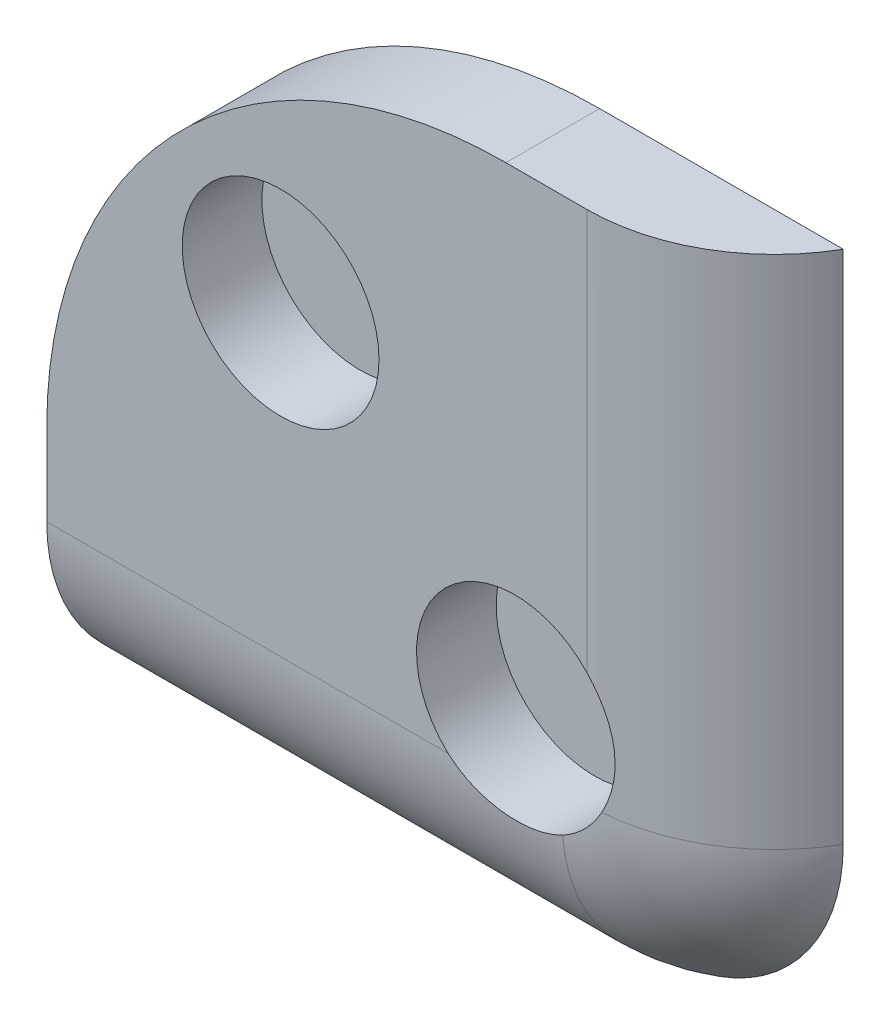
ISO-10303-21;
HEADER;
FILE_DESCRIPTION(('STEP AP214'),'2;1');
FILE_NAME('part.step','',(''),(''),'','','');
FILE_SCHEMA(('AUTOMOTIVE_DESIGN { 1 0 10303 214 1 1 1 1 }'));
ENDSEC;
DATA;
#1=APPLICATION_CONTEXT('core data for automotive mechanical design processes');
#2=APPLICATION_PROTOCOL_DEFINITION('international standard','automotive_design',2000,#1);
#3=PRODUCT_CONTEXT('',#1,'mechanical');
#4=PRODUCT('Part','Part','',(#3));
#5=PRODUCT_RELATED_PRODUCT_CATEGORY('part','',(#4));
#6=PRODUCT_DEFINITION_FORMATION('','',#4);
#7=PRODUCT_DEFINITION_CONTEXT('part definition',#1,'design');
#8=PRODUCT_DEFINITION('design','',#6,#7);
#9=PRODUCT_DEFINITION_SHAPE('','',#8);
#10=(LENGTH_UNIT() NAMED_UNIT(*) SI_UNIT(.MILLI.,.METRE.));
#11=(NAMED_UNIT(*) PLANE_ANGLE_UNIT() SI_UNIT($,.RADIAN.));
#12=(NAMED_UNIT(*) SI_UNIT($,.STERADIAN.) SOLID_ANGLE_UNIT());
#13=UNCERTAINTY_MEASURE_WITH_UNIT(LENGTH_MEASURE(1.E-05),#10,'distance_accuracy_value','');
#14=(GEOMETRIC_REPRESENTATION_CONTEXT(3) GLOBAL_UNCERTAINTY_ASSIGNED_CONTEXT((#13)) GLOBAL_UNIT_ASSIGNED_CONTEXT((#10,
#11,#12)) REPRESENTATION_CONTEXT('',''));
#15=CARTESIAN_POINT('',(0.,0.,0.));
#16=DIRECTION('',(0.,0.,1.));
#17=DIRECTION('',(1.,0.,0.));
#18=AXIS2_PLACEMENT_3D('',#15,#16,#17);
#19=CARTESIAN_POINT('',(-7.5,-7.5,-1.));
#20=DIRECTION('',(-1.,0.,0.));
#21=DIRECTION('',(0.,-1.,0.));
#22=AXIS2_PLACEMENT_3D('',#19,#20,#21);
#23=PLANE('',#22);
#24=DIRECTION('',(0.,-1.,0.));
#25=VECTOR('',#24,1.);
#26=CARTESIAN_POINT('',(-7.5,-7.5,-1.));
#27=LINE('',#26,#25);
#28=CARTESIAN_POINT('',(-7.5,-2.3,-1.));
#29=VERTEX_POINT('',#28);
#30=CARTESIAN_POINT('',(-7.5,-7.5,-1.));
#31=VERTEX_POINT('',#30);
#32=EDGE_CURVE('E162',#29,#31,#27,.T.);
#33=ORIENTED_EDGE('',*,*,#32,.T.);
#34=CARTESIAN_POINT('',(-7.5,-4.03589838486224,-3.));
#35=DIRECTION('',(-1.,0.,0.));
#36=DIRECTION('',(0.,-1.,0.));
#37=AXIS2_PLACEMENT_3D('',#34,#35,#36);
#38=CIRCLE('',#37,4.);
#39=CARTESIAN_POINT('',(-7.5,-4.03589838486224,1.));
#40=VERTEX_POINT('',#39);
#41=EDGE_CURVE('E56',#31,#40,#38,.T.);
#42=ORIENTED_EDGE('',*,*,#41,.T.);
#43=DIRECTION('',(0.,-1.,0.));
#44=VECTOR('',#43,1.);
#45=CARTESIAN_POINT('',(-7.5,-7.5,1.));
#46=LINE('',#45,#44);
#47=CARTESIAN_POINT('',(-7.5,-2.3,1.));
#48=VERTEX_POINT('',#47);
#49=EDGE_CURVE('E144',#48,#40,#46,.T.);
#50=ORIENTED_EDGE('',*,*,#49,.F.);
#51=DIRECTION('',(0.,0.,1.));
#52=VECTOR('',#51,1.);
#53=CARTESIAN_POINT('',(-7.5,-2.3,-1.));
#54=LINE('',#53,#52);
#55=EDGE_CURVE('E168',#29,#48,#54,.T.);
#56=ORIENTED_EDGE('',*,*,#55,.F.);
#57=EDGE_LOOP('',(#33,#42,#50,#56));
#58=FACE_BOUND('',#57,.T.);
#59=ADVANCED_FACE('F41',(#58),#23,.T.);
#60=CARTESIAN_POINT('',(2.3,-2.3,-1.));
#61=DIRECTION('',(0.,0.,1.));
#62=DIRECTION('',(1.,0.,0.));
#63=AXIS2_PLACEMENT_3D('',#60,#61,#62);
#64=CYLINDRICAL_SURFACE('',#63,9.8);
#65=ORIENTED_EDGE('',*,*,#55,.T.);
#66=CARTESIAN_POINT('',(2.3,-2.3,1.));
#67=DIRECTION('',(0.,0.,1.));
#68=DIRECTION('',(-1.,0.,0.));
#69=AXIS2_PLACEMENT_3D('',#66,#67,#68);
#70=CIRCLE('',#69,9.8);
#71=CARTESIAN_POINT('',(2.3,7.5,1.));
#72=VERTEX_POINT('',#71);
#73=EDGE_CURVE('E140',#72,#48,#70,.T.);
#74=ORIENTED_EDGE('',*,*,#73,.F.);
#75=DIRECTION('',(0.,0.,1.));
#76=VECTOR('',#75,1.);
#77=CARTESIAN_POINT('',(2.3,7.5,-1.));
#78=LINE('',#77,#76);
#79=CARTESIAN_POINT('',(2.3,7.5,-1.));
#80=VERTEX_POINT('',#79);
#81=EDGE_CURVE('E167',#80,#72,#78,.T.);
#82=ORIENTED_EDGE('',*,*,#81,.F.);
#83=CARTESIAN_POINT('',(2.3,-2.3,-1.));
#84=DIRECTION('',(0.,0.,1.));
#85=DIRECTION('',(-1.,0.,0.));
#86=AXIS2_PLACEMENT_3D('',#83,#84,#85);
#87=CIRCLE('',#86,9.8);
#88=EDGE_CURVE('E159',#80,#29,#87,.T.);
#89=ORIENTED_EDGE('',*,*,#88,.T.);
#90=EDGE_LOOP('',(#65,#74,#82,#89));
#91=FACE_BOUND('',#90,.T.);
#92=ADVANCED_FACE('F207',(#91),#64,.T.);
#93=CARTESIAN_POINT('',(2.3,7.5,-1.));
#94=DIRECTION('',(0.,1.,0.));
#95=DIRECTION('',(-1.,0.,0.));
#96=AXIS2_PLACEMENT_3D('',#93,#94,#95);
#97=PLANE('',#96);
#98=DIRECTION('',(-1.,0.,0.));
#99=VECTOR('',#98,1.);
#100=CARTESIAN_POINT('',(2.3,7.5,1.));
#101=LINE('',#100,#99);
#102=CARTESIAN_POINT('',(4.03589838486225,7.5,1.));
#103=VERTEX_POINT('',#102);
#104=EDGE_CURVE('E135',#103,#72,#101,.T.);
#105=ORIENTED_EDGE('',*,*,#104,.F.);
#106=CARTESIAN_POINT('',(4.03589838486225,7.5,-3.));
#107=DIRECTION('',(0.,1.,0.));
#108=DIRECTION('',(-1.,0.,0.));
#109=AXIS2_PLACEMENT_3D('',#106,#107,#108);
#110=CIRCLE('',#109,4.);
#111=CARTESIAN_POINT('',(7.5,7.5,-1.));
#112=VERTEX_POINT('',#111);
#113=EDGE_CURVE('E123',#103,#112,#110,.T.);
#114=ORIENTED_EDGE('',*,*,#113,.T.);
#115=DIRECTION('',(-1.,0.,0.));
#116=VECTOR('',#115,1.);
#117=CARTESIAN_POINT('',(2.3,7.5,-1.));
#118=LINE('',#117,#116);
#119=EDGE_CURVE('E156',#112,#80,#118,.T.);
#120=ORIENTED_EDGE('',*,*,#119,.T.);
#121=ORIENTED_EDGE('',*,*,#81,.T.);
#122=EDGE_LOOP('',(#105,#114,#120,#121));
#123=FACE_BOUND('',#122,.T.);
#124=ADVANCED_FACE('F204',(#123),#97,.T.);
#125=CARTESIAN_POINT('',(2.3,-2.3,-1.));
#126=DIRECTION('',(0.,0.,-1.));
#127=DIRECTION('',(-1.,0.,0.));
#128=AXIS2_PLACEMENT_3D('',#125,#126,#127);
#129=PLANE('',#128);
#130=DIRECTION('',(0.,1.,0.));
#131=VECTOR('',#130,1.);
#132=CARTESIAN_POINT('',(7.5,-7.5,-1.));
#133=LINE('',#132,#131);
#134=CARTESIAN_POINT('',(7.5,-3.5,-1.));
#135=VERTEX_POINT('',#134);
#136=EDGE_CURVE('E154',#135,#112,#133,.T.);
#137=ORIENTED_EDGE('',*,*,#136,.F.);
#138=CARTESIAN_POINT('',(3.5,-3.5,-1.));
#139=DIRECTION('',(0.,0.,-1.));
#140=DIRECTION('',(-1.,0.,0.));
#141=AXIS2_PLACEMENT_3D('',#138,#139,#140);
#142=CIRCLE('',#141,4.);
#143=CARTESIAN_POINT('',(3.5,-7.5,-1.));
#144=VERTEX_POINT('',#143);
#145=EDGE_CURVE('E127',#135,#144,#142,.T.);
#146=ORIENTED_EDGE('',*,*,#145,.T.);
#147=DIRECTION('',(1.,0.,0.));
#148=VECTOR('',#147,1.);
#149=CARTESIAN_POINT('',(-7.5,-7.5,-1.));
#150=LINE('',#149,#148);
#151=EDGE_CURVE('E164',#31,#144,#150,.T.);
#152=ORIENTED_EDGE('',*,*,#151,.F.);
#153=ORIENTED_EDGE('',*,*,#32,.F.);
#154=ORIENTED_EDGE('',*,*,#88,.F.);
#155=ORIENTED_EDGE('',*,*,#119,.F.);
#156=EDGE_LOOP('',(#137,#146,#152,#153,#154,#155));
#157=FACE_BOUND('',#156,.T.);
#158=ADVANCED_FACE('F173',(#157),#129,.T.);
#159=CARTESIAN_POINT('',(2.3,-2.3,1.));
#160=DIRECTION('',(0.,0.,-1.));
#161=DIRECTION('',(-1.,0.,0.));
#162=AXIS2_PLACEMENT_3D('',#159,#160,#161);
#163=PLANE('',#162);
#164=CARTESIAN_POINT('',(-2.50832611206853,2.50832611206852,1.));
#165=DIRECTION('',(0.,0.,1.));
#166=DIRECTION('',(1.,0.,0.));
#167=AXIS2_PLACEMENT_3D('',#164,#165,#166);
#168=CIRCLE('',#167,2.1);
#169=CARTESIAN_POINT('',(-0.408326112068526,2.50832611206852,1.));
#170=VERTEX_POINT('',#169);
#171=EDGE_CURVE('E118',#170,#170,#168,.T.);
#172=ORIENTED_EDGE('',*,*,#171,.F.);
#173=EDGE_LOOP('',(#172));
#174=FACE_BOUND('',#173,.T.);
#175=DIRECTION('',(1.,0.,0.));
#176=VECTOR('',#175,1.);
#177=CARTESIAN_POINT('',(2.3,-4.03589838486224,1.));
#178=LINE('',#177,#176);
#179=CARTESIAN_POINT('',(1.06851869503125,-4.03589838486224,1.));
#180=VERTEX_POINT('',#179);
#181=EDGE_CURVE('E117',#40,#180,#178,.T.);
#182=ORIENTED_EDGE('',*,*,#181,.T.);
#183=CARTESIAN_POINT('',(2.49167388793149,-2.49167388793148,1.));
#184=DIRECTION('',(0.,0.,1.));
#185=DIRECTION('',(1.,0.,0.));
#186=AXIS2_PLACEMENT_3D('',#183,#184,#185);
#187=CIRCLE('',#186,2.1);
#188=CARTESIAN_POINT('',(4.03589838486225,-1.06851869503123,1.));
#189=VERTEX_POINT('',#188);
#190=EDGE_CURVE('E106',#189,#180,#187,.T.);
#191=ORIENTED_EDGE('',*,*,#190,.F.);
#192=DIRECTION('',(0.,1.,0.));
#193=VECTOR('',#192,1.);
#194=CARTESIAN_POINT('',(4.03589838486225,-2.3,1.));
#195=LINE('',#194,#193);
#196=EDGE_CURVE('E114',#189,#103,#195,.T.);
#197=ORIENTED_EDGE('',*,*,#196,.T.);
#198=ORIENTED_EDGE('',*,*,#104,.T.);
#199=ORIENTED_EDGE('',*,*,#73,.T.);
#200=ORIENTED_EDGE('',*,*,#49,.T.);
#201=EDGE_LOOP('',(#182,#191,#197,#198,#199,#200));
#202=FACE_BOUND('',#201,.T.);
#203=ADVANCED_FACE('F113',(#174,#202),#163,.F.);
#204=CARTESIAN_POINT('',(-7.5,-4.03589838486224,-3.));
#205=DIRECTION('',(1.,0.,0.));
#206=DIRECTION('',(0.,1.,0.));
#207=AXIS2_PLACEMENT_3D('',#204,#205,#206);
#208=CYLINDRICAL_SURFACE('',#207,4.);
#209=CARTESIAN_POINT('',(1.29891616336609,-0.76328475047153,-0.7));
#210=CARTESIAN_POINT('',(1.24232976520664,-0.802378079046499,-0.644351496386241));
#211=CARTESIAN_POINT('',(1.18795494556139,-0.843966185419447,-0.588215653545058));
#212=CARTESIAN_POINT('',(1.08359246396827,-0.932180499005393,-0.47571405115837));
#213=CARTESIAN_POINT('',(1.0336083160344,-0.978810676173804,-0.419348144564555));
#214=CARTESIAN_POINT('',(0.937667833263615,-1.07752076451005,-0.306737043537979));
#215=CARTESIAN_POINT('',(0.891750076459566,-1.12964432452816,-0.250497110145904));
#216=CARTESIAN_POINT('',(0.804752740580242,-1.2390045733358,-0.139324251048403));
#217=CARTESIAN_POINT('',(0.763671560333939,-1.29623955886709,-0.0843908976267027));
#218=CARTESIAN_POINT('',(0.661279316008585,-1.45550925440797,0.0593318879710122));
#219=CARTESIAN_POINT('',(0.604576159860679,-1.56212165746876,0.146463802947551));
#220=CARTESIAN_POINT('',(0.509011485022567,-1.78875654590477,0.312090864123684));
#221=CARTESIAN_POINT('',(0.470090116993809,-1.90873233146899,0.390614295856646));
#222=CARTESIAN_POINT('',(0.41918827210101,-2.13697373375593,0.52251218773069));
#223=CARTESIAN_POINT('',(0.403546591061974,-2.24327540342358,0.577848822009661));
#224=CARTESIAN_POINT('',(0.389051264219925,-2.46147747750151,0.679079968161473));
#225=CARTESIAN_POINT('',(0.390193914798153,-2.57337664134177,0.724976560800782));
#226=CARTESIAN_POINT('',(0.41130669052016,-2.80004103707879,0.806208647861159));
#227=CARTESIAN_POINT('',(0.431386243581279,-2.91481915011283,0.84148118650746));
#228=CARTESIAN_POINT('',(0.491482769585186,-3.14207985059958,0.900623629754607));
#229=CARTESIAN_POINT('',(0.531492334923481,-3.25456327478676,0.92449776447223));
#230=CARTESIAN_POINT('',(0.625886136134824,-3.46144134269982,0.959786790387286));
#231=CARTESIAN_POINT('',(0.67841733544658,-3.55651693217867,0.972214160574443));
#232=CARTESIAN_POINT('',(0.797905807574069,-3.73784322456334,0.989920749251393));
#233=CARTESIAN_POINT('',(0.86486358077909,-3.82409362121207,0.995199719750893));
#234=CARTESIAN_POINT('',(1.01181611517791,-3.98566775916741,1.00050774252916));
#235=CARTESIAN_POINT('',(1.09187972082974,-4.0609295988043,1.00050812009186));
#236=CARTESIAN_POINT('',(1.26271695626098,-4.19803531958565,0.997302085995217));
#237=CARTESIAN_POINT('',(1.35349339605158,-4.25987566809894,0.994094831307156));
#238=CARTESIAN_POINT('',(1.54903147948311,-4.37178891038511,0.986291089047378));
#239=CARTESIAN_POINT('',(1.65429785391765,-4.42097690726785,0.981625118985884));
#240=CARTESIAN_POINT('',(1.87152244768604,-4.50135724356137,0.973033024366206));
#241=CARTESIAN_POINT('',(1.98348111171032,-4.53254838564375,0.969106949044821));
#242=CARTESIAN_POINT('',(2.21328463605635,-4.57648643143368,0.963366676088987));
#243=CARTESIAN_POINT('',(2.33120153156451,-4.58886403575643,0.961594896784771));
#244=CARTESIAN_POINT('',(2.56744187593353,-4.59362950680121,0.960926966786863));
#245=CARTESIAN_POINT('',(2.6857653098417,-4.58601810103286,0.962030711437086));
#246=CARTESIAN_POINT('',(2.918318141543,-4.5512059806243,0.966705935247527));
#247=CARTESIAN_POINT('',(3.03257521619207,-4.52418640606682,0.970254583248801));
#248=CARTESIAN_POINT('',(3.25498016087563,-4.45153441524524,0.978513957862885));
#249=CARTESIAN_POINT('',(3.36312698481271,-4.40589882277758,0.983224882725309));
#250=CARTESIAN_POINT('',(3.57121376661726,-4.29680741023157,0.991858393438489));
#251=CARTESIAN_POINT('',(3.67107855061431,-4.23320749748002,0.995774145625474));
#252=CARTESIAN_POINT('',(3.85877826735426,-4.09009412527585,1.00027145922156));
#253=CARTESIAN_POINT('',(3.94661410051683,-4.01058185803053,1.00085327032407));
#254=CARTESIAN_POINT('',(4.10669785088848,-3.83900421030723,0.996060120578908));
#255=CARTESIAN_POINT('',(4.17911466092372,-3.74709503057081,0.99075413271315));
#256=CARTESIAN_POINT('',(4.3073806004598,-3.55313809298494,0.97195203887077));
#257=CARTESIAN_POINT('',(4.36323940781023,-3.45109630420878,0.958460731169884));
#258=CARTESIAN_POINT('',(4.4542516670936,-3.24671556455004,0.922668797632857));
#259=CARTESIAN_POINT('',(4.49040261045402,-3.144724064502,0.900913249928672));
#260=CARTESIAN_POINT('',(4.54631430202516,-2.93871400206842,0.848049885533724));
#261=CARTESIAN_POINT('',(4.56607553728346,-2.83469550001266,0.816942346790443));
#262=CARTESIAN_POINT('',(4.58964956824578,-2.62955705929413,0.746173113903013));
#263=CARTESIAN_POINT('',(4.59369202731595,-2.52841698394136,0.706643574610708));
#264=CARTESIAN_POINT('',(4.58779991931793,-2.33008876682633,0.619662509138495));
#265=CARTESIAN_POINT('',(4.5778632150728,-2.23290123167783,0.57220977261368));
#266=CARTESIAN_POINT('',(4.54403347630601,-2.03454768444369,0.465336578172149));
#267=CARTESIAN_POINT('',(4.51880531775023,-1.93400705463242,0.405186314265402));
#268=CARTESIAN_POINT('',(4.45566133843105,-1.74130014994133,0.278441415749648));
#269=CARTESIAN_POINT('',(4.41772934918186,-1.64914473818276,0.211838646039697));
#270=CARTESIAN_POINT('',(4.30889760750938,-1.42884400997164,0.038369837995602));
#271=CARTESIAN_POINT('',(4.23106967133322,-1.3065055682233,-0.0716152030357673));
#272=CARTESIAN_POINT('',(4.09964395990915,-1.13909443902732,-0.240495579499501));
#273=CARTESIAN_POINT('',(4.05335685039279,-1.08594723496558,-0.297473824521));
#274=CARTESIAN_POINT('',(3.95610961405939,-0.984909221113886,-0.412089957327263));
#275=CARTESIAN_POINT('',(3.9051521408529,-0.937015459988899,-0.469727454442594));
#276=CARTESIAN_POINT('',(3.82513632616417,-0.868986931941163,-0.556226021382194));
#277=CARTESIAN_POINT('',(3.79778369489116,-0.846887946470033,-0.58514939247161));
#278=CARTESIAN_POINT('',(3.74196395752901,-0.804070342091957,-0.642761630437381));
#279=CARTESIAN_POINT('',(3.71349982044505,-0.783348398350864,-0.671450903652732));
#280=CARTESIAN_POINT('',(3.68443161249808,-0.763284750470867,-0.700000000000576));
#281=B_SPLINE_CURVE_WITH_KNOTS('',3,(#209,#210,#211,#212,#213,#214,#215,#216,#217,#218,#219,
#220,#221,#222,#223,#224,#225,#226,#227,#228,#229,#230,#231,#232,#233,#234,#235,#236,#237,#238,
#239,#240,#241,#242,#243,#244,#245,#246,#247,#248,#249,#250,#251,#252,#253,#254,#255,#256,#257,
#258,#259,#260,#261,#262,#263,#264,#265,#266,#267,#268,#269,#270,#271,#272,#273,#274,#275,#276,
#277,#278,#279,#280),.UNSPECIFIED.,.F.,.F.,(4,2,2,2,2,2,2,2,2,2,2,2,2,2,2,2,2,2,2,2,2,2,2,2,2,2,
2,2,2,2,2,2,2,2,2,4),(0.,0.265339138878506,0.530888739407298,0.798735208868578,1.06649275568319,
1.51147844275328,1.95495517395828,2.31606178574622,2.67708871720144,3.04021472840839,
3.40320587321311,3.72964719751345,4.05609984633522,4.38432587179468,4.71263818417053,
5.05989464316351,5.40717420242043,5.76118642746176,6.11518576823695,6.4659233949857,
6.81672088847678,7.17041619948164,7.52408502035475,7.87365409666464,8.22301845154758,
8.55249896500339,8.88196968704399,9.20660809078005,9.5312961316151,9.88950995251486,
10.2481814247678,10.7909569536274,11.0626613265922,11.3342122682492,11.4707776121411,
11.607000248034),.UNSPECIFIED.);
#282=CARTESIAN_POINT('',(3.5,-4.33375924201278,0.988894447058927));
#283=VERTEX_POINT('',#282);
#284=EDGE_CURVE('E134',#180,#283,#281,.T.);
#285=ORIENTED_EDGE('',*,*,#284,.F.);
#286=ORIENTED_EDGE('',*,*,#181,.F.);
#287=ORIENTED_EDGE('',*,*,#41,.F.);
#288=ORIENTED_EDGE('',*,*,#151,.T.);
#289=CARTESIAN_POINT('',(3.5,-4.03589838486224,-3.));
#290=DIRECTION('',(1.,0.,0.));
#291=DIRECTION('',(0.,0.,-1.));
#292=AXIS2_PLACEMENT_3D('',#289,#290,#291);
#293=CIRCLE('',#292,4.);
#294=EDGE_CURVE('E133',#283,#144,#293,.T.);
#295=ORIENTED_EDGE('',*,*,#294,.F.);
#296=EDGE_LOOP('',(#285,#286,#287,#288,#295));
#297=FACE_BOUND('',#296,.T.);
#298=ADVANCED_FACE('F43',(#297),#208,.T.);
#299=CARTESIAN_POINT('',(3.5,-3.5,-3.));
#300=DIRECTION('',(0.,0.,1.));
#301=DIRECTION('',(1.,0.,0.));
#302=AXIS2_PLACEMENT_3D('',#299,#300,#301);
#303=DEGENERATE_TOROIDAL_SURFACE('',#302,0.535898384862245,4.,.T.);
#304=CARTESIAN_POINT('',(3.49980000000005,-4.33386870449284,0.988886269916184));
#305=CARTESIAN_POINT('',(3.55164024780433,-4.30550748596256,0.991009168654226));
#306=CARTESIAN_POINT('',(3.60228866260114,-4.27493969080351,0.992622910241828));
#307=CARTESIAN_POINT('',(3.70084849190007,-4.20963319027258,0.995079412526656));
#308=CARTESIAN_POINT('',(3.74875964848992,-4.17489409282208,0.995922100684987));
#309=CARTESIAN_POINT('',(3.84039813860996,-4.10235046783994,0.997069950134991));
#310=CARTESIAN_POINT('',(3.88419708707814,-4.06463656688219,0.997387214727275));
#311=CARTESIAN_POINT('',(3.96852637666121,-3.98574286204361,0.997671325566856));
#312=CARTESIAN_POINT('',(4.00905752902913,-3.94456392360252,0.997638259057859));
#313=CARTESIAN_POINT('',(4.1027013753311,-3.84121349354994,0.997126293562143));
#314=CARTESIAN_POINT('',(4.15404728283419,-3.7774269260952,0.996467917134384));
#315=CARTESIAN_POINT('',(4.24977171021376,-3.64321027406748,0.993839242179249));
#316=CARTESIAN_POINT('',(4.29401749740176,-3.57268596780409,0.991846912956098));
#317=CARTESIAN_POINT('',(4.33386870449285,-3.49980000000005,0.988886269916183));
#318=B_SPLINE_CURVE_WITH_KNOTS('',3,(#304,#305,#306,#307,#308,#309,#310,#311,#312,#313,#314,
#315,#316,#317),.UNSPECIFIED.,.F.,.F.,(4,2,2,2,2,2,4),(0.,0.17732646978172,0.354669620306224,
0.527867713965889,0.701022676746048,0.946099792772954,1.19532769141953),.UNSPECIFIED.);
#319=CARTESIAN_POINT('',(4.33375924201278,-3.5,0.988894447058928));
#320=VERTEX_POINT('',#319);
#321=EDGE_CURVE('E62',#283,#320,#318,.T.);
#322=ORIENTED_EDGE('',*,*,#321,.F.);
#323=ORIENTED_EDGE('',*,*,#294,.T.);
#324=ORIENTED_EDGE('',*,*,#145,.F.);
#325=CARTESIAN_POINT('',(4.03589838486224,-3.5,-3.));
#326=DIRECTION('',(0.,1.,0.));
#327=DIRECTION('',(-1.,0.,0.));
#328=AXIS2_PLACEMENT_3D('',#325,#326,#327);
#329=CIRCLE('',#328,4.);
#330=EDGE_CURVE('E132',#320,#135,#329,.T.);
#331=ORIENTED_EDGE('',*,*,#330,.F.);
#332=EDGE_LOOP('',(#322,#323,#324,#331));
#333=FACE_BOUND('',#332,.T.);
#334=ADVANCED_FACE('F185',(#333),#303,.T.);
#335=CARTESIAN_POINT('',(4.03589838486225,-7.5,-3.));
#336=DIRECTION('',(0.,1.,0.));
#337=DIRECTION('',(0.,0.,1.));
#338=AXIS2_PLACEMENT_3D('',#335,#336,#337);
#339=CYLINDRICAL_SURFACE('',#338,4.);
#340=CARTESIAN_POINT('',(0.763284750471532,-3.68443161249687,-0.7));
#341=CARTESIAN_POINT('',(0.8023780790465,-3.74101801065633,-0.644351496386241));
#342=CARTESIAN_POINT('',(0.843966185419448,-3.79539283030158,-0.588215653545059));
#343=CARTESIAN_POINT('',(0.932180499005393,-3.8997553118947,-0.475714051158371));
#344=CARTESIAN_POINT('',(0.978810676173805,-3.94973945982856,-0.419348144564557));
#345=CARTESIAN_POINT('',(1.07752076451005,-4.04567994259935,-0.30673704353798));
#346=CARTESIAN_POINT('',(1.12964432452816,-4.0915976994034,-0.250497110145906));
#347=CARTESIAN_POINT('',(1.2390045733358,-4.17859503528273,-0.139324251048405));
#348=CARTESIAN_POINT('',(1.29623955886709,-4.21967621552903,-0.0843908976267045));
#349=CARTESIAN_POINT('',(1.45550925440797,-4.32206845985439,0.0593318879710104));
#350=CARTESIAN_POINT('',(1.56212165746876,-4.37877161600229,0.146463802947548));
#351=CARTESIAN_POINT('',(1.78875654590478,-4.47433629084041,0.312090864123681));
#352=CARTESIAN_POINT('',(1.90873233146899,-4.51325765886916,0.390614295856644));
#353=CARTESIAN_POINT('',(2.13697373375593,-4.56415950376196,0.522512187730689));
#354=CARTESIAN_POINT('',(2.24327540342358,-4.579801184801,0.57784882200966));
#355=CARTESIAN_POINT('',(2.4614774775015,-4.59429651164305,0.679079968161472));
#356=CARTESIAN_POINT('',(2.57337664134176,-4.59315386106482,0.724976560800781));
#357=CARTESIAN_POINT('',(2.80004103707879,-4.57204108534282,0.806208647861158));
#358=CARTESIAN_POINT('',(2.91481915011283,-4.5519615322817,0.841481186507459));
#359=CARTESIAN_POINT('',(3.14207985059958,-4.49186500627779,0.900623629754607));
#360=CARTESIAN_POINT('',(3.25456327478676,-4.4518554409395,0.924497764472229));
#361=CARTESIAN_POINT('',(3.46144134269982,-4.35746163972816,0.959786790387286));
#362=CARTESIAN_POINT('',(3.55651693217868,-4.3049304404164,0.972214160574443));
#363=CARTESIAN_POINT('',(3.73784322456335,-4.18544196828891,0.989920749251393));
#364=CARTESIAN_POINT('',(3.82409362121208,-4.11848419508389,0.995199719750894));
#365=CARTESIAN_POINT('',(3.98566775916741,-3.97153166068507,1.00050774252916));
#366=CARTESIAN_POINT('',(4.0609295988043,-3.89146805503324,1.00050812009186));
#367=CARTESIAN_POINT('',(4.19803531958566,-3.72063081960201,0.997302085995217));
#368=CARTESIAN_POINT('',(4.25987566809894,-3.62985437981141,0.994094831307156));
#369=CARTESIAN_POINT('',(4.37178891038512,-3.43431629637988,0.986291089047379));
#370=CARTESIAN_POINT('',(4.42097690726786,-3.32904992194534,0.981625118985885));
#371=CARTESIAN_POINT('',(4.50135724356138,-3.11182532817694,0.973033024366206));
#372=CARTESIAN_POINT('',(4.53254838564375,-2.99986666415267,0.96910694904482));
#373=CARTESIAN_POINT('',(4.57648643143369,-2.77006313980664,0.963366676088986));
#374=CARTESIAN_POINT('',(4.58886403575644,-2.65214624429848,0.96159489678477));
#375=CARTESIAN_POINT('',(4.59362950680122,-2.41590589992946,0.960926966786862));
#376=CARTESIAN_POINT('',(4.58601810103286,-2.29758246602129,0.962030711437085));
#377=CARTESIAN_POINT('',(4.55120598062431,-2.06502963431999,0.966705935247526));
#378=CARTESIAN_POINT('',(4.52418640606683,-1.95077255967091,0.9702545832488));
#379=CARTESIAN_POINT('',(4.45153441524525,-1.72836761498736,0.978513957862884));
#380=CARTESIAN_POINT('',(4.40589882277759,-1.62022079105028,0.983224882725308));
#381=CARTESIAN_POINT('',(4.29680741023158,-1.41213400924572,0.991858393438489));
#382=CARTESIAN_POINT('',(4.23320749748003,-1.31226922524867,0.995774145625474));
#383=CARTESIAN_POINT('',(4.09009412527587,-1.12456950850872,1.00027145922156));
#384=CARTESIAN_POINT('',(4.01058185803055,-1.03673367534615,1.00085327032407));
#385=CARTESIAN_POINT('',(3.83900421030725,-0.876649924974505,0.996060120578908));
#386=CARTESIAN_POINT('',(3.74709503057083,-0.804233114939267,0.990754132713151));
#387=CARTESIAN_POINT('',(3.55313809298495,-0.675967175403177,0.971952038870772));
#388=CARTESIAN_POINT('',(3.4510963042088,-0.620108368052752,0.958460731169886));
#389=CARTESIAN_POINT('',(3.24671556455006,-0.529096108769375,0.922668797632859));
#390=CARTESIAN_POINT('',(3.14472406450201,-0.492945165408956,0.900913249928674));
#391=CARTESIAN_POINT('',(2.93871400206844,-0.437033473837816,0.848049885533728));
#392=CARTESIAN_POINT('',(2.83469550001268,-0.417272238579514,0.816942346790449));
#393=CARTESIAN_POINT('',(2.62955705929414,-0.393698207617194,0.74617311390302));
#394=CARTESIAN_POINT('',(2.52841698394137,-0.389655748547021,0.706643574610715));
#395=CARTESIAN_POINT('',(2.33008876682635,-0.395547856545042,0.619662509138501));
#396=CARTESIAN_POINT('',(2.23290123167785,-0.405484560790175,0.572209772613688));
#397=CARTESIAN_POINT('',(2.03454768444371,-0.439314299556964,0.465336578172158));
#398=CARTESIAN_POINT('',(1.93400705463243,-0.464542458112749,0.405186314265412));
#399=CARTESIAN_POINT('',(1.74130014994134,-0.527686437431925,0.27844141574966));
#400=CARTESIAN_POINT('',(1.64914473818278,-0.565618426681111,0.211838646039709));
#401=CARTESIAN_POINT('',(1.42884400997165,-0.674450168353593,0.0383698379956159));
#402=CARTESIAN_POINT('',(1.30650556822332,-0.752278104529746,-0.0716152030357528));
#403=CARTESIAN_POINT('',(1.13909443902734,-0.883703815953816,-0.240495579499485));
#404=CARTESIAN_POINT('',(1.08594723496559,-0.929990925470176,-0.297473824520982));
#405=CARTESIAN_POINT('',(0.984909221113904,-1.02723816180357,-0.412089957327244));
#406=CARTESIAN_POINT('',(0.937015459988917,-1.07819563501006,-0.469727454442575));
#407=CARTESIAN_POINT('',(0.868986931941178,-1.1582114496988,-0.556226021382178));
#408=CARTESIAN_POINT('',(0.846887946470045,-1.18556408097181,-0.585149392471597));
#409=CARTESIAN_POINT('',(0.804070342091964,-1.24138381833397,-0.642761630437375));
#410=CARTESIAN_POINT('',(0.783348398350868,-1.26984795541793,-0.67145090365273));
#411=CARTESIAN_POINT('',(0.76328475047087,-1.29891616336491,-0.700000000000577));
#412=B_SPLINE_CURVE_WITH_KNOTS('',3,(#340,#341,#342,#343,#344,#345,#346,#347,#348,#349,#350,
#351,#352,#353,#354,#355,#356,#357,#358,#359,#360,#361,#362,#363,#364,#365,#366,#367,#368,#369,
#370,#371,#372,#373,#374,#375,#376,#377,#378,#379,#380,#381,#382,#383,#384,#385,#386,#387,#388,
#389,#390,#391,#392,#393,#394,#395,#396,#397,#398,#399,#400,#401,#402,#403,#404,#405,#406,#407,
#408,#409,#410,#411),.UNSPECIFIED.,.F.,.F.,(4,2,2,2,2,2,2,2,2,2,2,2,2,2,2,2,2,2,2,2,2,2,2,2,2,2,
2,2,2,2,2,2,2,2,2,4),(0.,0.265339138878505,0.530888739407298,0.798735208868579,1.06649275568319,
1.51147844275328,1.95495517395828,2.31606178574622,2.67708871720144,3.04021472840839,
3.40320587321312,3.72964719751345,4.05609984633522,4.38432587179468,4.71263818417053,
5.05989464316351,5.40717420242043,5.76118642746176,6.11518576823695,6.4659233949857,
6.81672088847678,7.17041619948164,7.52408502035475,7.87365409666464,8.22301845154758,
8.55249896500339,8.88196968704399,9.20660809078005,9.5312961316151,9.88950995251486,
10.2481814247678,10.7909569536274,11.0626613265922,11.3342122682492,11.4707776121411,
11.607000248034),.UNSPECIFIED.);
#413=EDGE_CURVE('E11',#320,#189,#412,.T.);
#414=ORIENTED_EDGE('',*,*,#413,.F.);
#415=ORIENTED_EDGE('',*,*,#330,.T.);
#416=ORIENTED_EDGE('',*,*,#136,.T.);
#417=ORIENTED_EDGE('',*,*,#113,.F.);
#418=ORIENTED_EDGE('',*,*,#196,.F.);
#419=EDGE_LOOP('',(#414,#415,#416,#417,#418));
#420=FACE_BOUND('',#419,.T.);
#421=ADVANCED_FACE('F121',(#420),#339,.T.);
#422=CARTESIAN_POINT('',(2.49167388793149,-2.49167388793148,-0.7));
#423=DIRECTION('',(0.,0.,1.));
#424=DIRECTION('',(1.,0.,0.));
#425=AXIS2_PLACEMENT_3D('',#422,#423,#424);
#426=CYLINDRICAL_SURFACE('',#425,2.1);
#427=ORIENTED_EDGE('',*,*,#284,.T.);
#428=ORIENTED_EDGE('',*,*,#321,.T.);
#429=ORIENTED_EDGE('',*,*,#413,.T.);
#430=ORIENTED_EDGE('',*,*,#190,.T.);
#431=EDGE_LOOP('',(#427,#428,#429,#430));
#432=FACE_BOUND('',#431,.T.);
#433=CARTESIAN_POINT('',(2.49167388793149,-2.49167388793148,-0.7));
#434=DIRECTION('',(0.,0.,1.));
#435=DIRECTION('',(1.,0.,0.));
#436=AXIS2_PLACEMENT_3D('',#433,#434,#435);
#437=CIRCLE('',#436,2.1);
#438=CARTESIAN_POINT('',(4.59167388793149,-2.49167388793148,-0.7));
#439=VERTEX_POINT('',#438);
#440=EDGE_CURVE('E119',#439,#439,#437,.T.);
#441=ORIENTED_EDGE('',*,*,#440,.F.);
#442=EDGE_LOOP('',(#441));
#443=FACE_BOUND('',#442,.T.);
#444=ADVANCED_FACE('F104',(#432,#443),#426,.F.);
#445=CARTESIAN_POINT('',(2.49167388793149,-2.49167388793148,-0.7));
#446=DIRECTION('',(0.,0.,1.));
#447=DIRECTION('',(1.,0.,0.));
#448=AXIS2_PLACEMENT_3D('',#445,#446,#447);
#449=PLANE('',#448);
#450=ORIENTED_EDGE('',*,*,#440,.T.);
#451=EDGE_LOOP('',(#450));
#452=FACE_BOUND('',#451,.T.);
#453=ADVANCED_FACE('F191',(#452),#449,.T.);
#454=CARTESIAN_POINT('',(-2.50832611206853,2.50832611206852,-0.7));
#455=DIRECTION('',(0.,0.,1.));
#456=DIRECTION('',(1.,0.,0.));
#457=AXIS2_PLACEMENT_3D('',#454,#455,#456);
#458=CYLINDRICAL_SURFACE('',#457,2.1);
#459=CARTESIAN_POINT('',(-2.50832611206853,2.50832611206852,-0.7));
#460=DIRECTION('',(0.,0.,1.));
#461=DIRECTION('',(1.,0.,0.));
#462=AXIS2_PLACEMENT_3D('',#459,#460,#461);
#463=CIRCLE('',#462,2.1);
#464=CARTESIAN_POINT('',(-0.408326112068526,2.50832611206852,-0.7));
#465=VERTEX_POINT('',#464);
#466=EDGE_CURVE('E177',#465,#465,#463,.T.);
#467=ORIENTED_EDGE('',*,*,#466,.F.);
#468=EDGE_LOOP('',(#467));
#469=FACE_BOUND('',#468,.T.);
#470=ORIENTED_EDGE('',*,*,#171,.T.);
#471=EDGE_LOOP('',(#470));
#472=FACE_BOUND('',#471,.T.);
#473=ADVANCED_FACE('F192',(#469,#472),#458,.F.);
#474=CARTESIAN_POINT('',(-2.50832611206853,2.50832611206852,-0.7));
#475=DIRECTION('',(0.,0.,1.));
#476=DIRECTION('',(1.,0.,0.));
#477=AXIS2_PLACEMENT_3D('',#474,#475,#476);
#478=PLANE('',#477);
#479=ORIENTED_EDGE('',*,*,#466,.T.);
#480=EDGE_LOOP('',(#479));
#481=FACE_BOUND('',#480,.T.);
#482=ADVANCED_FACE('F282',(#481),#478,.T.);
#483=CLOSED_SHELL('',(#59,#92,#124,#158,#203,#298,#334,#421,#444,#453,#473,#482));
#484=MANIFOLD_SOLID_BREP('B2',#483);
#485=ADVANCED_BREP_SHAPE_REPRESENTATION('',(#18,#484),#14);
#486=SHAPE_DEFINITION_REPRESENTATION(#9,#485);
ENDSEC;
END-ISO-10303-21;
